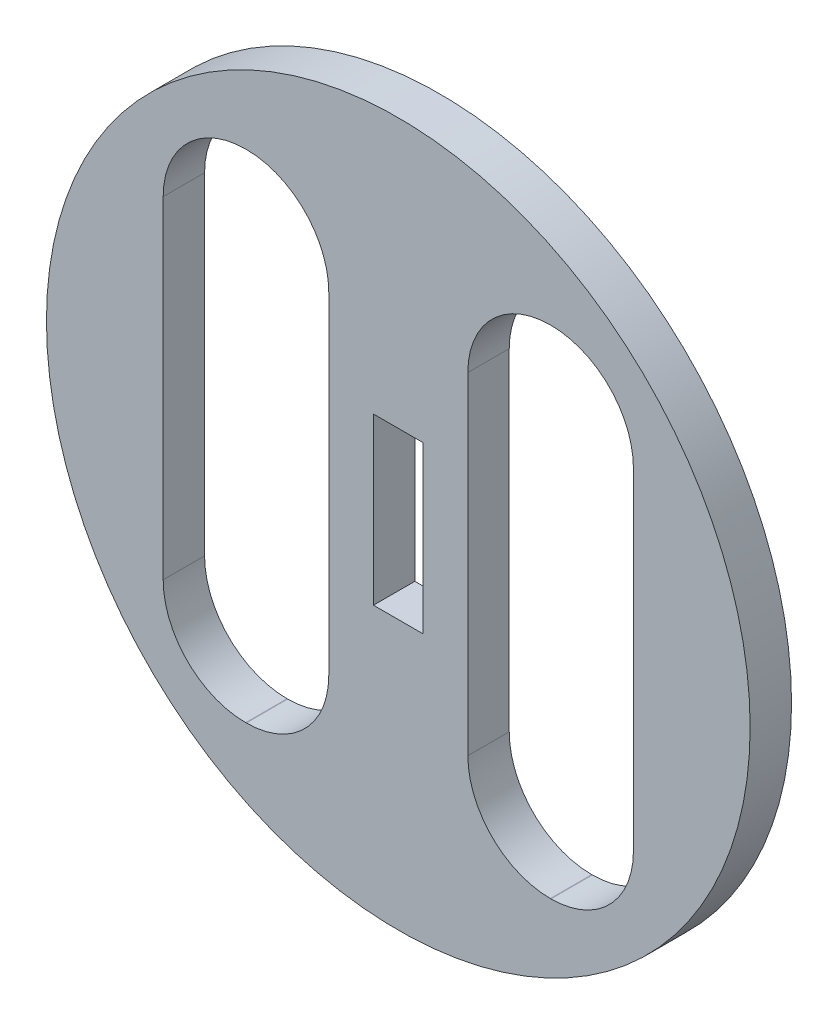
ISO-10303-21;
HEADER;
FILE_DESCRIPTION(('STEP AP214'),'2;1');
FILE_NAME('part.step','',(''),(''),'','','');
FILE_SCHEMA(('AUTOMOTIVE_DESIGN { 1 0 10303 214 1 1 1 1 }'));
ENDSEC;
DATA;
#1=APPLICATION_CONTEXT('core data for automotive mechanical design processes');
#2=APPLICATION_PROTOCOL_DEFINITION('international standard','automotive_design',2000,#1);
#3=PRODUCT_CONTEXT('',#1,'mechanical');
#4=PRODUCT('Part','Part','',(#3));
#5=PRODUCT_RELATED_PRODUCT_CATEGORY('part','',(#4));
#6=PRODUCT_DEFINITION_FORMATION('','',#4);
#7=PRODUCT_DEFINITION_CONTEXT('part definition',#1,'design');
#8=PRODUCT_DEFINITION('design','',#6,#7);
#9=PRODUCT_DEFINITION_SHAPE('','',#8);
#10=(LENGTH_UNIT() NAMED_UNIT(*) SI_UNIT(.MILLI.,.METRE.));
#11=(NAMED_UNIT(*) PLANE_ANGLE_UNIT() SI_UNIT($,.RADIAN.));
#12=(NAMED_UNIT(*) SI_UNIT($,.STERADIAN.) SOLID_ANGLE_UNIT());
#13=UNCERTAINTY_MEASURE_WITH_UNIT(LENGTH_MEASURE(1.E-05),#10,'distance_accuracy_value','');
#14=(GEOMETRIC_REPRESENTATION_CONTEXT(3) GLOBAL_UNCERTAINTY_ASSIGNED_CONTEXT((#13)) GLOBAL_UNIT_ASSIGNED_CONTEXT((#10,
#11,#12)) REPRESENTATION_CONTEXT('',''));
#15=CARTESIAN_POINT('',(0.,0.,0.));
#16=DIRECTION('',(0.,0.,1.));
#17=DIRECTION('',(1.,0.,0.));
#18=AXIS2_PLACEMENT_3D('',#15,#16,#17);
#19=CARTESIAN_POINT('',(0.,0.,3.175));
#20=DIRECTION('',(0.,0.,1.));
#21=DIRECTION('',(1.,0.,0.));
#22=AXIS2_PLACEMENT_3D('',#19,#20,#21);
#23=PLANE('',#22);
#24=DIRECTION('',(0.,-1.,0.));
#25=VECTOR('',#24,1.);
#26=CARTESIAN_POINT('',(5.334,12.7254,3.175));
#27=LINE('',#26,#25);
#28=CARTESIAN_POINT('',(5.334,12.7254,3.175));
#29=VERTEX_POINT('',#28);
#30=CARTESIAN_POINT('',(5.334,-12.7254,3.175));
#31=VERTEX_POINT('',#30);
#32=EDGE_CURVE('E231',#29,#31,#27,.T.);
#33=ORIENTED_EDGE('',*,*,#32,.F.);
#34=CARTESIAN_POINT('',(11.6586,12.7254,3.175));
#35=DIRECTION('',(0.,0.,1.));
#36=DIRECTION('',(-1.,0.,0.));
#37=AXIS2_PLACEMENT_3D('',#34,#35,#36);
#38=CIRCLE('',#37,6.3246);
#39=CARTESIAN_POINT('',(11.6586,19.05,3.175));
#40=VERTEX_POINT('',#39);
#41=EDGE_CURVE('E229',#40,#29,#38,.T.);
#42=ORIENTED_EDGE('',*,*,#41,.F.);
#43=DIRECTION('',(-1.,0.,0.));
#44=VECTOR('',#43,1.);
#45=CARTESIAN_POINT('',(11.6586,19.05,3.175));
#46=LINE('',#45,#44);
#47=CARTESIAN_POINT('',(11.7094,19.05,3.175));
#48=VERTEX_POINT('',#47);
#49=EDGE_CURVE('E244',#48,#40,#46,.T.);
#50=ORIENTED_EDGE('',*,*,#49,.F.);
#51=CARTESIAN_POINT('',(11.7094,12.7254,3.175));
#52=DIRECTION('',(0.,0.,1.));
#53=DIRECTION('',(1.,0.,0.));
#54=AXIS2_PLACEMENT_3D('',#51,#52,#53);
#55=CIRCLE('',#54,6.3246);
#56=CARTESIAN_POINT('',(18.034,12.7254,3.175));
#57=VERTEX_POINT('',#56);
#58=EDGE_CURVE('E241',#57,#48,#55,.T.);
#59=ORIENTED_EDGE('',*,*,#58,.F.);
#60=DIRECTION('',(0.,1.,0.));
#61=VECTOR('',#60,1.);
#62=CARTESIAN_POINT('',(18.034,12.7254,3.175));
#63=LINE('',#62,#61);
#64=CARTESIAN_POINT('',(18.034,-12.7254,3.175));
#65=VERTEX_POINT('',#64);
#66=EDGE_CURVE('E239',#65,#57,#63,.T.);
#67=ORIENTED_EDGE('',*,*,#66,.F.);
#68=CARTESIAN_POINT('',(11.7094,-12.7254,3.175));
#69=DIRECTION('',(0.,0.,1.));
#70=DIRECTION('',(1.,0.,0.));
#71=AXIS2_PLACEMENT_3D('',#68,#69,#70);
#72=CIRCLE('',#71,6.3246);
#73=CARTESIAN_POINT('',(11.7094,-19.05,3.175));
#74=VERTEX_POINT('',#73);
#75=EDGE_CURVE('E237',#74,#65,#72,.T.);
#76=ORIENTED_EDGE('',*,*,#75,.F.);
#77=DIRECTION('',(1.,0.,0.));
#78=VECTOR('',#77,1.);
#79=CARTESIAN_POINT('',(11.6586,-19.05,3.175));
#80=LINE('',#79,#78);
#81=CARTESIAN_POINT('',(11.6586,-19.05,3.175));
#82=VERTEX_POINT('',#81);
#83=EDGE_CURVE('E235',#82,#74,#80,.T.);
#84=ORIENTED_EDGE('',*,*,#83,.F.);
#85=CARTESIAN_POINT('',(11.6586,-12.7254,3.175));
#86=DIRECTION('',(0.,0.,1.));
#87=DIRECTION('',(1.,0.,0.));
#88=AXIS2_PLACEMENT_3D('',#85,#86,#87);
#89=CIRCLE('',#88,6.3246);
#90=EDGE_CURVE('E233',#31,#82,#89,.T.);
#91=ORIENTED_EDGE('',*,*,#90,.F.);
#92=EDGE_LOOP('',(#33,#42,#50,#59,#67,#76,#84,#91));
#93=FACE_BOUND('',#92,.T.);
#94=CARTESIAN_POINT('',(0.,0.,3.175));
#95=DIRECTION('',(0.,0.,1.));
#96=DIRECTION('',(1.,0.,0.));
#97=AXIS2_PLACEMENT_3D('',#94,#95,#96);
#98=CIRCLE('',#97,26.9875);
#99=CARTESIAN_POINT('',(26.9875,0.,3.175));
#100=VERTEX_POINT('',#99);
#101=EDGE_CURVE('E11',#100,#100,#98,.T.);
#102=ORIENTED_EDGE('',*,*,#101,.T.);
#103=EDGE_LOOP('',(#102));
#104=FACE_BOUND('',#103,.T.);
#105=DIRECTION('',(0.,-1.,0.));
#106=VECTOR('',#105,1.);
#107=CARTESIAN_POINT('',(-18.034,12.7254,3.175));
#108=LINE('',#107,#106);
#109=CARTESIAN_POINT('',(-18.034,12.7254,3.175));
#110=VERTEX_POINT('',#109);
#111=CARTESIAN_POINT('',(-18.034,-12.7254,3.175));
#112=VERTEX_POINT('',#111);
#113=EDGE_CURVE('E290',#110,#112,#108,.T.);
#114=ORIENTED_EDGE('',*,*,#113,.F.);
#115=CARTESIAN_POINT('',(-11.7094,12.7254,3.175));
#116=DIRECTION('',(0.,0.,1.));
#117=DIRECTION('',(-1.,0.,0.));
#118=AXIS2_PLACEMENT_3D('',#115,#116,#117);
#119=CIRCLE('',#118,6.3246);
#120=CARTESIAN_POINT('',(-11.7094,19.05,3.175));
#121=VERTEX_POINT('',#120);
#122=EDGE_CURVE('E288',#121,#110,#119,.T.);
#123=ORIENTED_EDGE('',*,*,#122,.F.);
#124=DIRECTION('',(-1.,0.,0.));
#125=VECTOR('',#124,1.);
#126=CARTESIAN_POINT('',(-11.7094,19.05,3.175));
#127=LINE('',#126,#125);
#128=CARTESIAN_POINT('',(-11.6586,19.05,3.175));
#129=VERTEX_POINT('',#128);
#130=EDGE_CURVE('E303',#129,#121,#127,.T.);
#131=ORIENTED_EDGE('',*,*,#130,.F.);
#132=CARTESIAN_POINT('',(-11.6586,12.7254,3.175));
#133=DIRECTION('',(0.,0.,1.));
#134=DIRECTION('',(1.,0.,0.));
#135=AXIS2_PLACEMENT_3D('',#132,#133,#134);
#136=CIRCLE('',#135,6.3246);
#137=CARTESIAN_POINT('',(-5.334,12.7254,3.175));
#138=VERTEX_POINT('',#137);
#139=EDGE_CURVE('E300',#138,#129,#136,.T.);
#140=ORIENTED_EDGE('',*,*,#139,.F.);
#141=DIRECTION('',(0.,1.,0.));
#142=VECTOR('',#141,1.);
#143=CARTESIAN_POINT('',(-5.334,12.7254,3.175));
#144=LINE('',#143,#142);
#145=CARTESIAN_POINT('',(-5.334,-12.7254,3.175));
#146=VERTEX_POINT('',#145);
#147=EDGE_CURVE('E298',#146,#138,#144,.T.);
#148=ORIENTED_EDGE('',*,*,#147,.F.);
#149=CARTESIAN_POINT('',(-11.6586,-12.7254,3.175));
#150=DIRECTION('',(0.,0.,1.));
#151=DIRECTION('',(1.,0.,0.));
#152=AXIS2_PLACEMENT_3D('',#149,#150,#151);
#153=CIRCLE('',#152,6.3246);
#154=CARTESIAN_POINT('',(-11.6586,-19.05,3.175));
#155=VERTEX_POINT('',#154);
#156=EDGE_CURVE('E296',#155,#146,#153,.T.);
#157=ORIENTED_EDGE('',*,*,#156,.F.);
#158=DIRECTION('',(1.,0.,0.));
#159=VECTOR('',#158,1.);
#160=CARTESIAN_POINT('',(-11.7094,-19.05,3.175));
#161=LINE('',#160,#159);
#162=CARTESIAN_POINT('',(-11.7094,-19.05,3.175));
#163=VERTEX_POINT('',#162);
#164=EDGE_CURVE('E294',#163,#155,#161,.T.);
#165=ORIENTED_EDGE('',*,*,#164,.F.);
#166=CARTESIAN_POINT('',(-11.7094,-12.7254,3.175));
#167=DIRECTION('',(0.,0.,1.));
#168=DIRECTION('',(-1.,0.,0.));
#169=AXIS2_PLACEMENT_3D('',#166,#167,#168);
#170=CIRCLE('',#169,6.3246);
#171=EDGE_CURVE('E292',#112,#163,#170,.T.);
#172=ORIENTED_EDGE('',*,*,#171,.F.);
#173=EDGE_LOOP('',(#114,#123,#131,#140,#148,#157,#165,#172));
#174=FACE_BOUND('',#173,.T.);
#175=DIRECTION('',(1.,0.,0.));
#176=VECTOR('',#175,1.);
#177=CARTESIAN_POINT('',(-1.905,-6.35,3.175));
#178=LINE('',#177,#176);
#179=CARTESIAN_POINT('',(-1.905,-6.35,3.175));
#180=VERTEX_POINT('',#179);
#181=CARTESIAN_POINT('',(1.905,-6.35,3.175));
#182=VERTEX_POINT('',#181);
#183=EDGE_CURVE('E196',#180,#182,#178,.T.);
#184=ORIENTED_EDGE('',*,*,#183,.F.);
#185=DIRECTION('',(0.,-1.,0.));
#186=VECTOR('',#185,1.);
#187=CARTESIAN_POINT('',(-1.905,6.35,3.175));
#188=LINE('',#187,#186);
#189=CARTESIAN_POINT('',(-1.905,6.35,3.175));
#190=VERTEX_POINT('',#189);
#191=EDGE_CURVE('E185',#190,#180,#188,.T.);
#192=ORIENTED_EDGE('',*,*,#191,.F.);
#193=DIRECTION('',(-1.,0.,0.));
#194=VECTOR('',#193,1.);
#195=CARTESIAN_POINT('',(-1.905,6.35,3.175));
#196=LINE('',#195,#194);
#197=CARTESIAN_POINT('',(1.905,6.35,3.175));
#198=VERTEX_POINT('',#197);
#199=EDGE_CURVE('E200',#198,#190,#196,.T.);
#200=ORIENTED_EDGE('',*,*,#199,.F.);
#201=DIRECTION('',(0.,1.,0.));
#202=VECTOR('',#201,1.);
#203=CARTESIAN_POINT('',(1.905,6.35,3.175));
#204=LINE('',#203,#202);
#205=EDGE_CURVE('E198',#182,#198,#204,.T.);
#206=ORIENTED_EDGE('',*,*,#205,.F.);
#207=EDGE_LOOP('',(#184,#192,#200,#206));
#208=FACE_BOUND('',#207,.T.);
#209=ADVANCED_FACE('F33',(#93,#104,#174,#208),#23,.T.);
#210=CARTESIAN_POINT('',(0.,0.,0.));
#211=DIRECTION('',(0.,0.,1.));
#212=DIRECTION('',(1.,0.,0.));
#213=AXIS2_PLACEMENT_3D('',#210,#211,#212);
#214=PLANE('',#213);
#215=CARTESIAN_POINT('',(11.6586,12.7254,0.));
#216=DIRECTION('',(0.,0.,1.));
#217=DIRECTION('',(-1.,0.,0.));
#218=AXIS2_PLACEMENT_3D('',#215,#216,#217);
#219=CIRCLE('',#218,6.3246);
#220=CARTESIAN_POINT('',(11.6586,19.05,0.));
#221=VERTEX_POINT('',#220);
#222=CARTESIAN_POINT('',(5.334,12.7254,0.));
#223=VERTEX_POINT('',#222);
#224=EDGE_CURVE('E186',#221,#223,#219,.T.);
#225=ORIENTED_EDGE('',*,*,#224,.T.);
#226=DIRECTION('',(0.,-1.,0.));
#227=VECTOR('',#226,1.);
#228=CARTESIAN_POINT('',(5.334,12.7254,0.));
#229=LINE('',#228,#227);
#230=CARTESIAN_POINT('',(5.334,-12.7254,0.));
#231=VERTEX_POINT('',#230);
#232=EDGE_CURVE('E208',#223,#231,#229,.T.);
#233=ORIENTED_EDGE('',*,*,#232,.T.);
#234=CARTESIAN_POINT('',(11.6586,-12.7254,0.));
#235=DIRECTION('',(0.,0.,1.));
#236=DIRECTION('',(1.,0.,0.));
#237=AXIS2_PLACEMENT_3D('',#234,#235,#236);
#238=CIRCLE('',#237,6.3246);
#239=CARTESIAN_POINT('',(11.6586,-19.05,0.));
#240=VERTEX_POINT('',#239);
#241=EDGE_CURVE('E211',#231,#240,#238,.T.);
#242=ORIENTED_EDGE('',*,*,#241,.T.);
#243=DIRECTION('',(1.,0.,0.));
#244=VECTOR('',#243,1.);
#245=CARTESIAN_POINT('',(11.6586,-19.05,0.));
#246=LINE('',#245,#244);
#247=CARTESIAN_POINT('',(11.7094,-19.05,0.));
#248=VERTEX_POINT('',#247);
#249=EDGE_CURVE('E214',#240,#248,#246,.T.);
#250=ORIENTED_EDGE('',*,*,#249,.T.);
#251=CARTESIAN_POINT('',(11.7094,-12.7254,0.));
#252=DIRECTION('',(0.,0.,1.));
#253=DIRECTION('',(1.,0.,0.));
#254=AXIS2_PLACEMENT_3D('',#251,#252,#253);
#255=CIRCLE('',#254,6.3246);
#256=CARTESIAN_POINT('',(18.034,-12.7254,0.));
#257=VERTEX_POINT('',#256);
#258=EDGE_CURVE('E217',#248,#257,#255,.T.);
#259=ORIENTED_EDGE('',*,*,#258,.T.);
#260=DIRECTION('',(0.,1.,0.));
#261=VECTOR('',#260,1.);
#262=CARTESIAN_POINT('',(18.034,12.7254,0.));
#263=LINE('',#262,#261);
#264=CARTESIAN_POINT('',(18.034,12.7254,0.));
#265=VERTEX_POINT('',#264);
#266=EDGE_CURVE('E220',#257,#265,#263,.T.);
#267=ORIENTED_EDGE('',*,*,#266,.T.);
#268=CARTESIAN_POINT('',(11.7094,12.7254,0.));
#269=DIRECTION('',(0.,0.,1.));
#270=DIRECTION('',(1.,0.,0.));
#271=AXIS2_PLACEMENT_3D('',#268,#269,#270);
#272=CIRCLE('',#271,6.3246);
#273=CARTESIAN_POINT('',(11.7094,19.05,0.));
#274=VERTEX_POINT('',#273);
#275=EDGE_CURVE('E223',#265,#274,#272,.T.);
#276=ORIENTED_EDGE('',*,*,#275,.T.);
#277=DIRECTION('',(-1.,0.,0.));
#278=VECTOR('',#277,1.);
#279=CARTESIAN_POINT('',(11.6586,19.05,0.));
#280=LINE('',#279,#278);
#281=EDGE_CURVE('E226',#274,#221,#280,.T.);
#282=ORIENTED_EDGE('',*,*,#281,.T.);
#283=EDGE_LOOP('',(#225,#233,#242,#250,#259,#267,#276,#282));
#284=FACE_BOUND('',#283,.T.);
#285=CARTESIAN_POINT('',(0.,0.,0.));
#286=DIRECTION('',(0.,0.,1.));
#287=DIRECTION('',(1.,0.,0.));
#288=AXIS2_PLACEMENT_3D('',#285,#286,#287);
#289=CIRCLE('',#288,26.9875);
#290=CARTESIAN_POINT('',(26.9875,0.,0.));
#291=VERTEX_POINT('',#290);
#292=EDGE_CURVE('E41',#291,#291,#289,.T.);
#293=ORIENTED_EDGE('',*,*,#292,.F.);
#294=EDGE_LOOP('',(#293));
#295=FACE_BOUND('',#294,.T.);
#296=CARTESIAN_POINT('',(-11.7094,12.7254,0.));
#297=DIRECTION('',(0.,0.,1.));
#298=DIRECTION('',(-1.,0.,0.));
#299=AXIS2_PLACEMENT_3D('',#296,#297,#298);
#300=CIRCLE('',#299,6.3246);
#301=CARTESIAN_POINT('',(-11.7094,19.05,0.));
#302=VERTEX_POINT('',#301);
#303=CARTESIAN_POINT('',(-18.034,12.7254,0.));
#304=VERTEX_POINT('',#303);
#305=EDGE_CURVE('E264',#302,#304,#300,.T.);
#306=ORIENTED_EDGE('',*,*,#305,.T.);
#307=DIRECTION('',(0.,-1.,0.));
#308=VECTOR('',#307,1.);
#309=CARTESIAN_POINT('',(-18.034,12.7254,0.));
#310=LINE('',#309,#308);
#311=CARTESIAN_POINT('',(-18.034,-12.7254,0.));
#312=VERTEX_POINT('',#311);
#313=EDGE_CURVE('E267',#304,#312,#310,.T.);
#314=ORIENTED_EDGE('',*,*,#313,.T.);
#315=CARTESIAN_POINT('',(-11.7094,-12.7254,0.));
#316=DIRECTION('',(0.,0.,1.));
#317=DIRECTION('',(-1.,0.,0.));
#318=AXIS2_PLACEMENT_3D('',#315,#316,#317);
#319=CIRCLE('',#318,6.3246);
#320=CARTESIAN_POINT('',(-11.7094,-19.05,0.));
#321=VERTEX_POINT('',#320);
#322=EDGE_CURVE('E270',#312,#321,#319,.T.);
#323=ORIENTED_EDGE('',*,*,#322,.T.);
#324=DIRECTION('',(1.,0.,0.));
#325=VECTOR('',#324,1.);
#326=CARTESIAN_POINT('',(-11.7094,-19.05,0.));
#327=LINE('',#326,#325);
#328=CARTESIAN_POINT('',(-11.6586,-19.05,0.));
#329=VERTEX_POINT('',#328);
#330=EDGE_CURVE('E273',#321,#329,#327,.T.);
#331=ORIENTED_EDGE('',*,*,#330,.T.);
#332=CARTESIAN_POINT('',(-11.6586,-12.7254,0.));
#333=DIRECTION('',(0.,0.,1.));
#334=DIRECTION('',(1.,0.,0.));
#335=AXIS2_PLACEMENT_3D('',#332,#333,#334);
#336=CIRCLE('',#335,6.3246);
#337=CARTESIAN_POINT('',(-5.334,-12.7254,0.));
#338=VERTEX_POINT('',#337);
#339=EDGE_CURVE('E276',#329,#338,#336,.T.);
#340=ORIENTED_EDGE('',*,*,#339,.T.);
#341=DIRECTION('',(0.,1.,0.));
#342=VECTOR('',#341,1.);
#343=CARTESIAN_POINT('',(-5.334,12.7254,0.));
#344=LINE('',#343,#342);
#345=CARTESIAN_POINT('',(-5.334,12.7254,0.));
#346=VERTEX_POINT('',#345);
#347=EDGE_CURVE('E279',#338,#346,#344,.T.);
#348=ORIENTED_EDGE('',*,*,#347,.T.);
#349=CARTESIAN_POINT('',(-11.6586,12.7254,0.));
#350=DIRECTION('',(0.,0.,1.));
#351=DIRECTION('',(1.,0.,0.));
#352=AXIS2_PLACEMENT_3D('',#349,#350,#351);
#353=CIRCLE('',#352,6.3246);
#354=CARTESIAN_POINT('',(-11.6586,19.05,0.));
#355=VERTEX_POINT('',#354);
#356=EDGE_CURVE('E282',#346,#355,#353,.T.);
#357=ORIENTED_EDGE('',*,*,#356,.T.);
#358=DIRECTION('',(-1.,0.,0.));
#359=VECTOR('',#358,1.);
#360=CARTESIAN_POINT('',(-11.7094,19.05,0.));
#361=LINE('',#360,#359);
#362=EDGE_CURVE('E285',#355,#302,#361,.T.);
#363=ORIENTED_EDGE('',*,*,#362,.T.);
#364=EDGE_LOOP('',(#306,#314,#323,#331,#340,#348,#357,#363));
#365=FACE_BOUND('',#364,.T.);
#366=DIRECTION('',(0.,-1.,0.));
#367=VECTOR('',#366,1.);
#368=CARTESIAN_POINT('',(-1.905,6.35,0.));
#369=LINE('',#368,#367);
#370=CARTESIAN_POINT('',(-1.905,6.35,0.));
#371=VERTEX_POINT('',#370);
#372=CARTESIAN_POINT('',(-1.905,-6.35,0.));
#373=VERTEX_POINT('',#372);
#374=EDGE_CURVE('E56',#371,#373,#369,.T.);
#375=ORIENTED_EDGE('',*,*,#374,.T.);
#376=DIRECTION('',(1.,0.,0.));
#377=VECTOR('',#376,1.);
#378=CARTESIAN_POINT('',(-1.905,-6.35,0.));
#379=LINE('',#378,#377);
#380=CARTESIAN_POINT('',(1.905,-6.35,0.));
#381=VERTEX_POINT('',#380);
#382=EDGE_CURVE('E172',#373,#381,#379,.T.);
#383=ORIENTED_EDGE('',*,*,#382,.T.);
#384=DIRECTION('',(0.,1.,0.));
#385=VECTOR('',#384,1.);
#386=CARTESIAN_POINT('',(1.905,6.35,0.));
#387=LINE('',#386,#385);
#388=CARTESIAN_POINT('',(1.905,6.35,0.));
#389=VERTEX_POINT('',#388);
#390=EDGE_CURVE('E181',#381,#389,#387,.T.);
#391=ORIENTED_EDGE('',*,*,#390,.T.);
#392=DIRECTION('',(-1.,0.,0.));
#393=VECTOR('',#392,1.);
#394=CARTESIAN_POINT('',(-1.905,6.35,0.));
#395=LINE('',#394,#393);
#396=EDGE_CURVE('E190',#389,#371,#395,.T.);
#397=ORIENTED_EDGE('',*,*,#396,.T.);
#398=EDGE_LOOP('',(#375,#383,#391,#397));
#399=FACE_BOUND('',#398,.T.);
#400=ADVANCED_FACE('F189',(#284,#295,#365,#399),#214,.F.);
#401=CARTESIAN_POINT('',(0.,0.,3.175));
#402=DIRECTION('',(0.,0.,-1.));
#403=DIRECTION('',(-1.,0.,0.));
#404=AXIS2_PLACEMENT_3D('',#401,#402,#403);
#405=CYLINDRICAL_SURFACE('',#404,26.9875);
#406=ORIENTED_EDGE('',*,*,#101,.F.);
#407=EDGE_LOOP('',(#406));
#408=FACE_BOUND('',#407,.T.);
#409=ORIENTED_EDGE('',*,*,#292,.T.);
#410=EDGE_LOOP('',(#409));
#411=FACE_BOUND('',#410,.T.);
#412=ADVANCED_FACE('F35',(#408,#411),#405,.T.);
#413=CARTESIAN_POINT('',(-11.7094,12.7254,3.175));
#414=DIRECTION('',(0.,0.,-1.));
#415=DIRECTION('',(-1.,0.,0.));
#416=AXIS2_PLACEMENT_3D('',#413,#414,#415);
#417=CYLINDRICAL_SURFACE('',#416,6.3246);
#418=ORIENTED_EDGE('',*,*,#305,.F.);
#419=DIRECTION('',(0.,0.,-1.));
#420=VECTOR('',#419,1.);
#421=CARTESIAN_POINT('',(-11.7094,19.05,3.175));
#422=LINE('',#421,#420);
#423=EDGE_CURVE('E305',#121,#302,#422,.T.);
#424=ORIENTED_EDGE('',*,*,#423,.F.);
#425=ORIENTED_EDGE('',*,*,#122,.T.);
#426=DIRECTION('',(0.,0.,-1.));
#427=VECTOR('',#426,1.);
#428=CARTESIAN_POINT('',(-18.034,12.7254,3.175));
#429=LINE('',#428,#427);
#430=EDGE_CURVE('E320',#110,#304,#429,.T.);
#431=ORIENTED_EDGE('',*,*,#430,.T.);
#432=EDGE_LOOP('',(#418,#424,#425,#431));
#433=FACE_BOUND('',#432,.T.);
#434=ADVANCED_FACE('F333',(#433),#417,.F.);
#435=CARTESIAN_POINT('',(-18.034,12.7254,3.175));
#436=DIRECTION('',(1.,0.,0.));
#437=DIRECTION('',(0.,1.,0.));
#438=AXIS2_PLACEMENT_3D('',#435,#436,#437);
#439=PLANE('',#438);
#440=ORIENTED_EDGE('',*,*,#313,.F.);
#441=ORIENTED_EDGE('',*,*,#430,.F.);
#442=ORIENTED_EDGE('',*,*,#113,.T.);
#443=DIRECTION('',(0.,0.,-1.));
#444=VECTOR('',#443,1.);
#445=CARTESIAN_POINT('',(-18.034,-12.7254,3.175));
#446=LINE('',#445,#444);
#447=EDGE_CURVE('E318',#112,#312,#446,.T.);
#448=ORIENTED_EDGE('',*,*,#447,.T.);
#449=EDGE_LOOP('',(#440,#441,#442,#448));
#450=FACE_BOUND('',#449,.T.);
#451=ADVANCED_FACE('F346',(#450),#439,.T.);
#452=CARTESIAN_POINT('',(-11.7094,-12.7254,3.175));
#453=DIRECTION('',(0.,0.,-1.));
#454=DIRECTION('',(-1.,0.,0.));
#455=AXIS2_PLACEMENT_3D('',#452,#453,#454);
#456=CYLINDRICAL_SURFACE('',#455,6.3246);
#457=ORIENTED_EDGE('',*,*,#322,.F.);
#458=ORIENTED_EDGE('',*,*,#447,.F.);
#459=ORIENTED_EDGE('',*,*,#171,.T.);
#460=DIRECTION('',(0.,0.,-1.));
#461=VECTOR('',#460,1.);
#462=CARTESIAN_POINT('',(-11.7094,-19.05,3.175));
#463=LINE('',#462,#461);
#464=EDGE_CURVE('E316',#163,#321,#463,.T.);
#465=ORIENTED_EDGE('',*,*,#464,.T.);
#466=EDGE_LOOP('',(#457,#458,#459,#465));
#467=FACE_BOUND('',#466,.T.);
#468=ADVANCED_FACE('F350',(#467),#456,.F.);
#469=CARTESIAN_POINT('',(-11.7094,-19.05,3.175));
#470=DIRECTION('',(0.,1.,0.));
#471=DIRECTION('',(0.,0.,1.));
#472=AXIS2_PLACEMENT_3D('',#469,#470,#471);
#473=PLANE('',#472);
#474=ORIENTED_EDGE('',*,*,#330,.F.);
#475=ORIENTED_EDGE('',*,*,#464,.F.);
#476=ORIENTED_EDGE('',*,*,#164,.T.);
#477=DIRECTION('',(0.,0.,-1.));
#478=VECTOR('',#477,1.);
#479=CARTESIAN_POINT('',(-11.6586,-19.05,3.175));
#480=LINE('',#479,#478);
#481=EDGE_CURVE('E314',#155,#329,#480,.T.);
#482=ORIENTED_EDGE('',*,*,#481,.T.);
#483=EDGE_LOOP('',(#474,#475,#476,#482));
#484=FACE_BOUND('',#483,.T.);
#485=ADVANCED_FACE('F355',(#484),#473,.T.);
#486=CARTESIAN_POINT('',(-11.6586,-12.7254,3.175));
#487=DIRECTION('',(0.,0.,-1.));
#488=DIRECTION('',(-1.,0.,0.));
#489=AXIS2_PLACEMENT_3D('',#486,#487,#488);
#490=CYLINDRICAL_SURFACE('',#489,6.3246);
#491=ORIENTED_EDGE('',*,*,#339,.F.);
#492=ORIENTED_EDGE('',*,*,#481,.F.);
#493=ORIENTED_EDGE('',*,*,#156,.T.);
#494=DIRECTION('',(0.,0.,-1.));
#495=VECTOR('',#494,1.);
#496=CARTESIAN_POINT('',(-5.334,-12.7254,3.175));
#497=LINE('',#496,#495);
#498=EDGE_CURVE('E312',#146,#338,#497,.T.);
#499=ORIENTED_EDGE('',*,*,#498,.T.);
#500=EDGE_LOOP('',(#491,#492,#493,#499));
#501=FACE_BOUND('',#500,.T.);
#502=ADVANCED_FACE('F360',(#501),#490,.F.);
#503=CARTESIAN_POINT('',(-5.334,12.7254,3.175));
#504=DIRECTION('',(-1.,0.,0.));
#505=DIRECTION('',(0.,-1.,0.));
#506=AXIS2_PLACEMENT_3D('',#503,#504,#505);
#507=PLANE('',#506);
#508=ORIENTED_EDGE('',*,*,#347,.F.);
#509=ORIENTED_EDGE('',*,*,#498,.F.);
#510=ORIENTED_EDGE('',*,*,#147,.T.);
#511=DIRECTION('',(0.,0.,-1.));
#512=VECTOR('',#511,1.);
#513=CARTESIAN_POINT('',(-5.334,12.7254,3.175));
#514=LINE('',#513,#512);
#515=EDGE_CURVE('E310',#138,#346,#514,.T.);
#516=ORIENTED_EDGE('',*,*,#515,.T.);
#517=EDGE_LOOP('',(#508,#509,#510,#516));
#518=FACE_BOUND('',#517,.T.);
#519=ADVANCED_FACE('F364',(#518),#507,.T.);
#520=CARTESIAN_POINT('',(-11.6586,12.7254,3.175));
#521=DIRECTION('',(0.,0.,-1.));
#522=DIRECTION('',(-1.,0.,0.));
#523=AXIS2_PLACEMENT_3D('',#520,#521,#522);
#524=CYLINDRICAL_SURFACE('',#523,6.3246);
#525=ORIENTED_EDGE('',*,*,#356,.F.);
#526=ORIENTED_EDGE('',*,*,#515,.F.);
#527=ORIENTED_EDGE('',*,*,#139,.T.);
#528=DIRECTION('',(0.,0.,-1.));
#529=VECTOR('',#528,1.);
#530=CARTESIAN_POINT('',(-11.6586,19.05,3.175));
#531=LINE('',#530,#529);
#532=EDGE_CURVE('E308',#129,#355,#531,.T.);
#533=ORIENTED_EDGE('',*,*,#532,.T.);
#534=EDGE_LOOP('',(#525,#526,#527,#533));
#535=FACE_BOUND('',#534,.T.);
#536=ADVANCED_FACE('F368',(#535),#524,.F.);
#537=CARTESIAN_POINT('',(-11.7094,19.05,3.175));
#538=DIRECTION('',(0.,-1.,0.));
#539=DIRECTION('',(0.,0.,-1.));
#540=AXIS2_PLACEMENT_3D('',#537,#538,#539);
#541=PLANE('',#540);
#542=ORIENTED_EDGE('',*,*,#362,.F.);
#543=ORIENTED_EDGE('',*,*,#532,.F.);
#544=ORIENTED_EDGE('',*,*,#130,.T.);
#545=ORIENTED_EDGE('',*,*,#423,.T.);
#546=EDGE_LOOP('',(#542,#543,#544,#545));
#547=FACE_BOUND('',#546,.T.);
#548=ADVANCED_FACE('F337',(#547),#541,.T.);
#549=CARTESIAN_POINT('',(11.6586,12.7254,3.175));
#550=DIRECTION('',(0.,0.,-1.));
#551=DIRECTION('',(-1.,0.,0.));
#552=AXIS2_PLACEMENT_3D('',#549,#550,#551);
#553=CYLINDRICAL_SURFACE('',#552,6.3246);
#554=ORIENTED_EDGE('',*,*,#224,.F.);
#555=DIRECTION('',(0.,0.,-1.));
#556=VECTOR('',#555,1.);
#557=CARTESIAN_POINT('',(11.6586,19.05,3.175));
#558=LINE('',#557,#556);
#559=EDGE_CURVE('E246',#40,#221,#558,.T.);
#560=ORIENTED_EDGE('',*,*,#559,.F.);
#561=ORIENTED_EDGE('',*,*,#41,.T.);
#562=DIRECTION('',(0.,0.,-1.));
#563=VECTOR('',#562,1.);
#564=CARTESIAN_POINT('',(5.334,12.7254,3.175));
#565=LINE('',#564,#563);
#566=EDGE_CURVE('E261',#29,#223,#565,.T.);
#567=ORIENTED_EDGE('',*,*,#566,.T.);
#568=EDGE_LOOP('',(#554,#560,#561,#567));
#569=FACE_BOUND('',#568,.T.);
#570=ADVANCED_FACE('F375',(#569),#553,.F.);
#571=CARTESIAN_POINT('',(5.334,12.7254,3.175));
#572=DIRECTION('',(1.,0.,0.));
#573=DIRECTION('',(0.,1.,0.));
#574=AXIS2_PLACEMENT_3D('',#571,#572,#573);
#575=PLANE('',#574);
#576=ORIENTED_EDGE('',*,*,#232,.F.);
#577=ORIENTED_EDGE('',*,*,#566,.F.);
#578=ORIENTED_EDGE('',*,*,#32,.T.);
#579=DIRECTION('',(0.,0.,-1.));
#580=VECTOR('',#579,1.);
#581=CARTESIAN_POINT('',(5.334,-12.7254,3.175));
#582=LINE('',#581,#580);
#583=EDGE_CURVE('E259',#31,#231,#582,.T.);
#584=ORIENTED_EDGE('',*,*,#583,.T.);
#585=EDGE_LOOP('',(#576,#577,#578,#584));
#586=FACE_BOUND('',#585,.T.);
#587=ADVANCED_FACE('F421',(#586),#575,.T.);
#588=CARTESIAN_POINT('',(11.6586,-12.7254,3.175));
#589=DIRECTION('',(0.,0.,-1.));
#590=DIRECTION('',(-1.,0.,0.));
#591=AXIS2_PLACEMENT_3D('',#588,#589,#590);
#592=CYLINDRICAL_SURFACE('',#591,6.3246);
#593=ORIENTED_EDGE('',*,*,#241,.F.);
#594=ORIENTED_EDGE('',*,*,#583,.F.);
#595=ORIENTED_EDGE('',*,*,#90,.T.);
#596=DIRECTION('',(0.,0.,-1.));
#597=VECTOR('',#596,1.);
#598=CARTESIAN_POINT('',(11.6586,-19.05,3.175));
#599=LINE('',#598,#597);
#600=EDGE_CURVE('E257',#82,#240,#599,.T.);
#601=ORIENTED_EDGE('',*,*,#600,.T.);
#602=EDGE_LOOP('',(#593,#594,#595,#601));
#603=FACE_BOUND('',#602,.T.);
#604=ADVANCED_FACE('F431',(#603),#592,.F.);
#605=CARTESIAN_POINT('',(11.6586,-19.05,3.175));
#606=DIRECTION('',(0.,1.,0.));
#607=DIRECTION('',(0.,0.,1.));
#608=AXIS2_PLACEMENT_3D('',#605,#606,#607);
#609=PLANE('',#608);
#610=ORIENTED_EDGE('',*,*,#249,.F.);
#611=ORIENTED_EDGE('',*,*,#600,.F.);
#612=ORIENTED_EDGE('',*,*,#83,.T.);
#613=DIRECTION('',(0.,0.,-1.));
#614=VECTOR('',#613,1.);
#615=CARTESIAN_POINT('',(11.7094,-19.05,3.175));
#616=LINE('',#615,#614);
#617=EDGE_CURVE('E255',#74,#248,#616,.T.);
#618=ORIENTED_EDGE('',*,*,#617,.T.);
#619=EDGE_LOOP('',(#610,#611,#612,#618));
#620=FACE_BOUND('',#619,.T.);
#621=ADVANCED_FACE('F441',(#620),#609,.T.);
#622=CARTESIAN_POINT('',(11.7094,-12.7254,3.175));
#623=DIRECTION('',(0.,0.,-1.));
#624=DIRECTION('',(-1.,0.,0.));
#625=AXIS2_PLACEMENT_3D('',#622,#623,#624);
#626=CYLINDRICAL_SURFACE('',#625,6.3246);
#627=ORIENTED_EDGE('',*,*,#258,.F.);
#628=ORIENTED_EDGE('',*,*,#617,.F.);
#629=ORIENTED_EDGE('',*,*,#75,.T.);
#630=DIRECTION('',(0.,0.,-1.));
#631=VECTOR('',#630,1.);
#632=CARTESIAN_POINT('',(18.034,-12.7254,3.175));
#633=LINE('',#632,#631);
#634=EDGE_CURVE('E253',#65,#257,#633,.T.);
#635=ORIENTED_EDGE('',*,*,#634,.T.);
#636=EDGE_LOOP('',(#627,#628,#629,#635));
#637=FACE_BOUND('',#636,.T.);
#638=ADVANCED_FACE('F451',(#637),#626,.F.);
#639=CARTESIAN_POINT('',(18.034,12.7254,3.175));
#640=DIRECTION('',(-1.,0.,0.));
#641=DIRECTION('',(0.,-1.,0.));
#642=AXIS2_PLACEMENT_3D('',#639,#640,#641);
#643=PLANE('',#642);
#644=ORIENTED_EDGE('',*,*,#266,.F.);
#645=ORIENTED_EDGE('',*,*,#634,.F.);
#646=ORIENTED_EDGE('',*,*,#66,.T.);
#647=DIRECTION('',(0.,0.,-1.));
#648=VECTOR('',#647,1.);
#649=CARTESIAN_POINT('',(18.034,12.7254,3.175));
#650=LINE('',#649,#648);
#651=EDGE_CURVE('E251',#57,#265,#650,.T.);
#652=ORIENTED_EDGE('',*,*,#651,.T.);
#653=EDGE_LOOP('',(#644,#645,#646,#652));
#654=FACE_BOUND('',#653,.T.);
#655=ADVANCED_FACE('F461',(#654),#643,.T.);
#656=CARTESIAN_POINT('',(11.7094,12.7254,3.175));
#657=DIRECTION('',(0.,0.,-1.));
#658=DIRECTION('',(-1.,0.,0.));
#659=AXIS2_PLACEMENT_3D('',#656,#657,#658);
#660=CYLINDRICAL_SURFACE('',#659,6.3246);
#661=ORIENTED_EDGE('',*,*,#275,.F.);
#662=ORIENTED_EDGE('',*,*,#651,.F.);
#663=ORIENTED_EDGE('',*,*,#58,.T.);
#664=DIRECTION('',(0.,0.,-1.));
#665=VECTOR('',#664,1.);
#666=CARTESIAN_POINT('',(11.7094,19.05,3.175));
#667=LINE('',#666,#665);
#668=EDGE_CURVE('E249',#48,#274,#667,.T.);
#669=ORIENTED_EDGE('',*,*,#668,.T.);
#670=EDGE_LOOP('',(#661,#662,#663,#669));
#671=FACE_BOUND('',#670,.T.);
#672=ADVANCED_FACE('F471',(#671),#660,.F.);
#673=CARTESIAN_POINT('',(11.6586,19.05,3.175));
#674=DIRECTION('',(0.,-1.,0.));
#675=DIRECTION('',(0.,0.,-1.));
#676=AXIS2_PLACEMENT_3D('',#673,#674,#675);
#677=PLANE('',#676);
#678=ORIENTED_EDGE('',*,*,#281,.F.);
#679=ORIENTED_EDGE('',*,*,#668,.F.);
#680=ORIENTED_EDGE('',*,*,#49,.T.);
#681=ORIENTED_EDGE('',*,*,#559,.T.);
#682=EDGE_LOOP('',(#678,#679,#680,#681));
#683=FACE_BOUND('',#682,.T.);
#684=ADVANCED_FACE('F481',(#683),#677,.T.);
#685=CARTESIAN_POINT('',(-1.905,6.35,3.175));
#686=DIRECTION('',(1.,0.,0.));
#687=DIRECTION('',(0.,1.,0.));
#688=AXIS2_PLACEMENT_3D('',#685,#686,#687);
#689=PLANE('',#688);
#690=ORIENTED_EDGE('',*,*,#374,.F.);
#691=DIRECTION('',(0.,0.,-1.));
#692=VECTOR('',#691,1.);
#693=CARTESIAN_POINT('',(-1.905,6.35,3.175));
#694=LINE('',#693,#692);
#695=EDGE_CURVE('E202',#190,#371,#694,.T.);
#696=ORIENTED_EDGE('',*,*,#695,.F.);
#697=ORIENTED_EDGE('',*,*,#191,.T.);
#698=DIRECTION('',(0.,0.,-1.));
#699=VECTOR('',#698,1.);
#700=CARTESIAN_POINT('',(-1.905,-6.35,3.175));
#701=LINE('',#700,#699);
#702=EDGE_CURVE('E174',#180,#373,#701,.T.);
#703=ORIENTED_EDGE('',*,*,#702,.T.);
#704=EDGE_LOOP('',(#690,#696,#697,#703));
#705=FACE_BOUND('',#704,.T.);
#706=ADVANCED_FACE('F183',(#705),#689,.T.);
#707=CARTESIAN_POINT('',(-1.905,-6.35,3.175));
#708=DIRECTION('',(0.,1.,0.));
#709=DIRECTION('',(0.,0.,1.));
#710=AXIS2_PLACEMENT_3D('',#707,#708,#709);
#711=PLANE('',#710);
#712=ORIENTED_EDGE('',*,*,#382,.F.);
#713=ORIENTED_EDGE('',*,*,#702,.F.);
#714=ORIENTED_EDGE('',*,*,#183,.T.);
#715=DIRECTION('',(0.,0.,-1.));
#716=VECTOR('',#715,1.);
#717=CARTESIAN_POINT('',(1.905,-6.35,3.175));
#718=LINE('',#717,#716);
#719=EDGE_CURVE('E177',#182,#381,#718,.T.);
#720=ORIENTED_EDGE('',*,*,#719,.T.);
#721=EDGE_LOOP('',(#712,#713,#714,#720));
#722=FACE_BOUND('',#721,.T.);
#723=ADVANCED_FACE('F173',(#722),#711,.T.);
#724=CARTESIAN_POINT('',(1.905,6.35,3.175));
#725=DIRECTION('',(-1.,0.,0.));
#726=DIRECTION('',(0.,-1.,0.));
#727=AXIS2_PLACEMENT_3D('',#724,#725,#726);
#728=PLANE('',#727);
#729=ORIENTED_EDGE('',*,*,#390,.F.);
#730=ORIENTED_EDGE('',*,*,#719,.F.);
#731=ORIENTED_EDGE('',*,*,#205,.T.);
#732=DIRECTION('',(0.,0.,-1.));
#733=VECTOR('',#732,1.);
#734=CARTESIAN_POINT('',(1.905,6.35,3.175));
#735=LINE('',#734,#733);
#736=EDGE_CURVE('E48',#198,#389,#735,.T.);
#737=ORIENTED_EDGE('',*,*,#736,.T.);
#738=EDGE_LOOP('',(#729,#730,#731,#737));
#739=FACE_BOUND('',#738,.T.);
#740=ADVANCED_FACE('F519',(#739),#728,.T.);
#741=CARTESIAN_POINT('',(-1.905,6.35,3.175));
#742=DIRECTION('',(0.,-1.,0.));
#743=DIRECTION('',(1.,0.,0.));
#744=AXIS2_PLACEMENT_3D('',#741,#742,#743);
#745=PLANE('',#744);
#746=ORIENTED_EDGE('',*,*,#396,.F.);
#747=ORIENTED_EDGE('',*,*,#736,.F.);
#748=ORIENTED_EDGE('',*,*,#199,.T.);
#749=ORIENTED_EDGE('',*,*,#695,.T.);
#750=EDGE_LOOP('',(#746,#747,#748,#749));
#751=FACE_BOUND('',#750,.T.);
#752=ADVANCED_FACE('F528',(#751),#745,.T.);
#753=CLOSED_SHELL('',(#209,#400,#412,#434,#451,#468,#485,#502,#519,#536,#548,#570,#587,#604,
#621,#638,#655,#672,#684,#706,#723,#740,#752));
#754=MANIFOLD_SOLID_BREP('B2',#753);
#755=ADVANCED_BREP_SHAPE_REPRESENTATION('',(#18,#754),#14);
#756=SHAPE_DEFINITION_REPRESENTATION(#9,#755);
ENDSEC;
END-ISO-10303-21;
